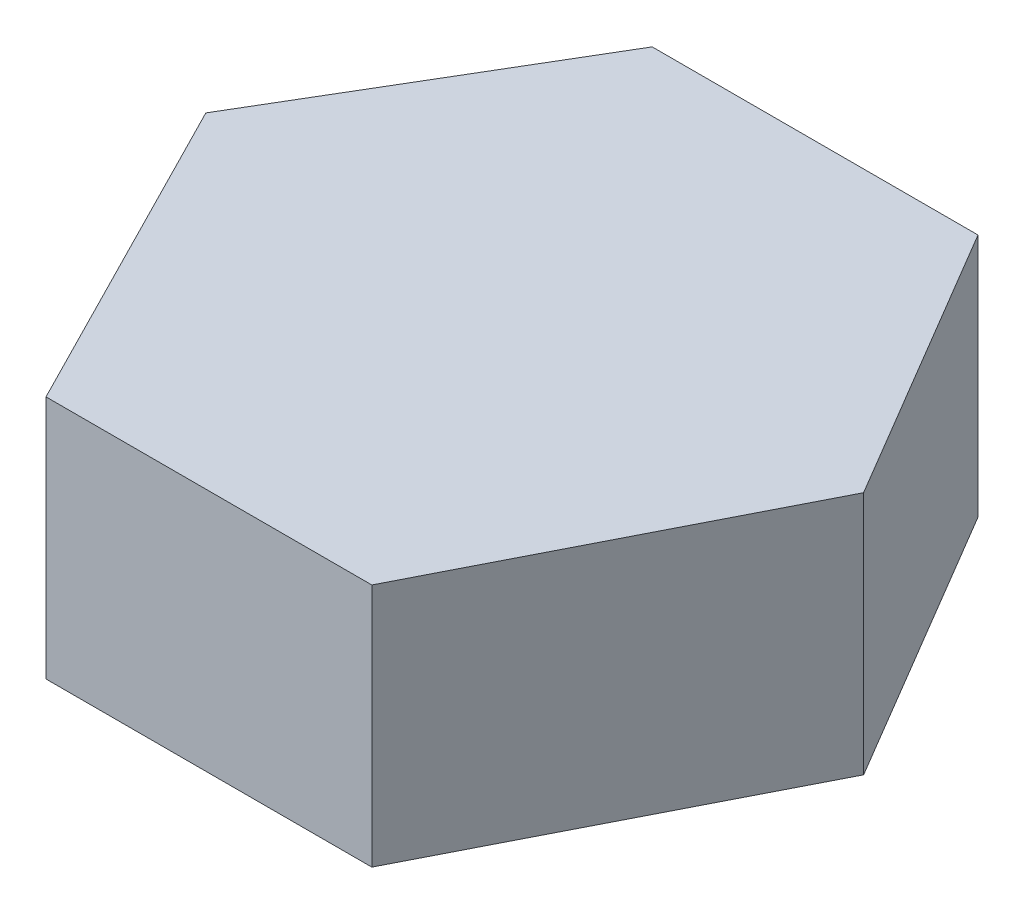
from build123d import *

# Parameters (mm, degrees)
EXTRUDE_1_DEPTH = 30


with BuildPart() as part:
    # Sketch 1 → Extrude 1 (new body)
    with BuildSketch(Plane(origin=(0, 0, 0), x_dir=(1, 0, 0), z_dir=(0, 1, 0))):
        Polygon((2.666703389, 34.420603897), (-37.333296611, 34.420603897), (-57.710294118, 0), (-37.333296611, -40), (2.666703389, -40), (23.043700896, 0), align=None)
    extrude(amount=EXTRUDE_1_DEPTH)


solid = part.part
